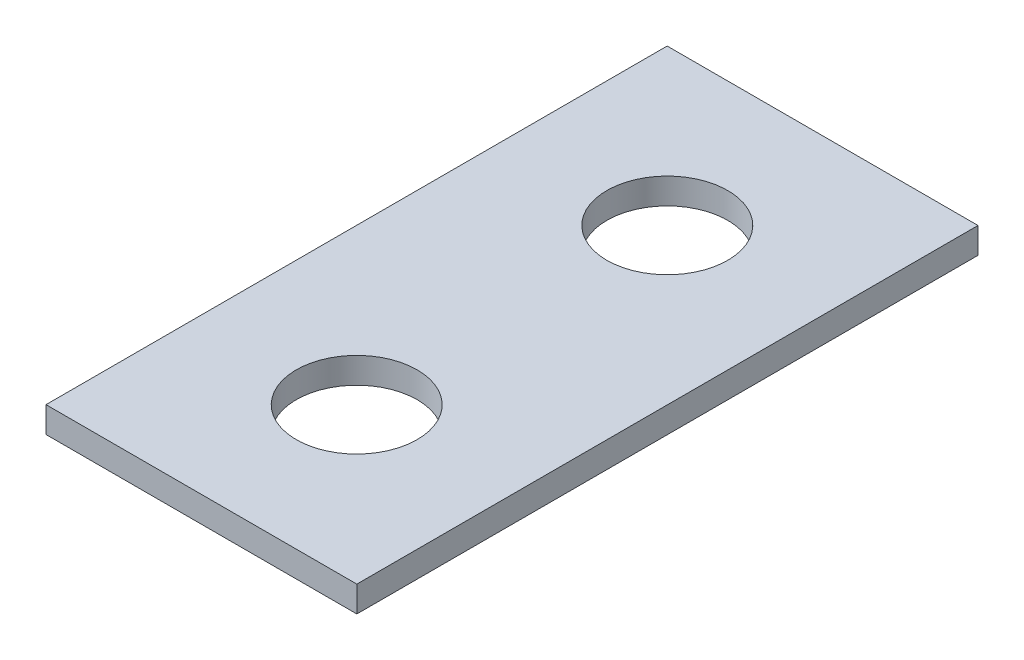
from build123d import *

# Parameters (mm, degrees)
SKETCH1_W           = 9.53262
SKETCH1_H           = 19.05
BOSS_EXTRUDE1_DEPTH = 0.79375
SKETCH2_R           = 1.8542
CUT_EXTRUDE1_DEPTH  = 11.680513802


with BuildPart() as part:
    # Sketch1 → Boss-Extrude1 (new body)
    with BuildSketch(Plane(origin=(0, 0, 0), x_dir=(1, 0, 0), z_dir=(0, 1, 0))):
        Rectangle(SKETCH1_W, SKETCH1_H)
    extrude(amount=BOSS_EXTRUDE1_DEPTH)

    # Sketch2 → Cut-Extrude1 (cut, through all)
    with BuildSketch(Plane(origin=(0, 0.79375, 0), x_dir=(1, 0, 0), z_dir=(0, 1, 0))):
        with Locations(Location((0, 4.7625, 0), (0, 0, 270))):
            Circle(SKETCH2_R)
        with Locations(Location((0, -4.7625, 0), (0, 0, 90))):
            Circle(SKETCH2_R)
    extrude(amount=-CUT_EXTRUDE1_DEPTH, mode=Mode.SUBTRACT)


solid = part.part
